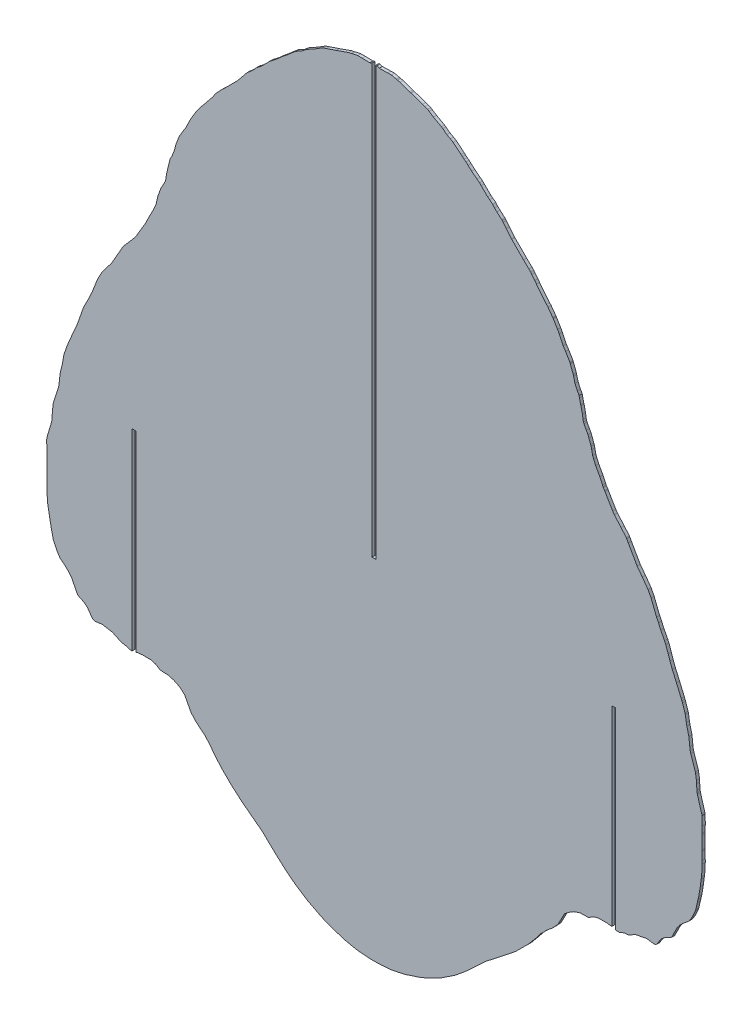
from build123d import *

# Parameters (mm, degrees)
EXTRUDE_1_DEPTH     = 2
SKETCH_3_W          = 2.5
SKETCH_3_H          = 60.5
CUT_EXTRUDE_1_DEPTH = 10


with BuildPart() as part:
    # Model → Extrude 1 (new body)
    with BuildSketch(Plane.XY):
        Polygon((-7497.9467, 2023.4558), (-7500.6426, 2017.1112), (-7501.0305, 2016.1207), (-7501.4279, 2015.1691), (-7503.0784, 2010.3746), (-7503.3023, 2009.66), (-7504.1535, 2004.848), (-7504.496, 2003.0145), (-7505.7197, 1998.1165), (-7506.4076, 1992.1158), (-7506.7012, 1990.1251), (-7506.946, 1989.2308), (-7510.1433, 1979.3137), (-7510.716, 1974.5936), (-7510.7209, 1974.5536), (-7510.7259, 1974.5137), (-7510.7487, 1974.0958), (-7510.7715, 1973.6781), (-7511.1722, 1968.5629), (-7511.4632, 1967.2933), (-7514.367, 1957.5712), (-7514.4008, 1956.9962), (-7514.4101, 1956.5912), (-7514.4193, 1956.1862), (-7514.4247, 1955.3981), (-7514.2628, 1947.1219), (-7514.2212, 1937.3397), (-7514.2091, 1936.9847), (-7514.3719, 1932.8768), (-7514.3864, 1930.5543), (-7514.1103, 1925.2838), (-7513.8456, 1921.2826), (-7513.1127, 1917.1886), (-7511.3726, 1907.7911), (-7510.8214, 1905.5643), (-7510.2805, 1902.9569), (-7507.7917, 1897.6613), (-7505.8454, 1894.5458), (-7503.2841, 1892.5111), (-7501.9998, 1891.3712), (-7499.9927, 1889.4144), (-7498.9104, 1887.8602), (-7498.3658, 1887.2845), (-7494.419, 1879.6002), (-7494.3736, 1879.5624), (-7494.3282, 1879.5245), (-7490.8269, 1877.798), (-7490.2704, 1877.4926), (-7488.3005, 1875.9325), (-7485.4491, 1871.9811), (-7484.6983, 1870.9366), (-7484.0835, 1870.7382), (-7483.4687, 1870.5397), (-7483.3924, 1870.4733), (-7483.316, 1870.4069), (-7482.274, 1870.5902), (-7478.4124, 1871.0638), (-7477.9965, 1870.9762), (-7477.5807, 1870.8885), (-7472.6305, 1870.0441), (-7472.0241, 1869.8947), (-7471.4176, 1869.745), (-7471.1804, 1869.6014), (-7470.9433, 1869.4576), (-7470.283, 1869.1666), (-7469.6228, 1868.8756), (-7466.2521, 1867.1725), (-7464.3822, 1866.9462), (-7463.2148, 1866.6659), (-7462.0473, 1866.3856), (-7461.513, 1866.0946), (-7460.9787, 1865.8033), (-7460.7605, 1865.7833), (-7460.5423, 1865.7633), (-7459.7682, 1865.7955), (-7459.2442, 1865.8174), (-7459.2442, 1990.1417), (-7458.9942, 1990.1417), (-7456.9942, 1990.1417), (-7456.7442, 1990.1417), (-7456.7442, 1866.3402), (-7456.4584, 1866.4423), (-7455.9226, 1866.6337), (-7452.735, 1866.9823), (-7447.3945, 1866.9166), (-7446.8888, 1866.9794), (-7444.6596, 1866.2577), (-7444.0137, 1866.0345), (-7441.2335, 1864.2804), (-7441.1634, 1864.2372), (-7441.0933, 1864.194), (-7441.0633, 1864.191), (-7441.0334, 1864.1881), (-7440.9624, 1864.1739), (-7440.8914, 1864.1595), (-7440.7779, 1864.1625), (-7440.6644, 1864.1652), (-7435.7736, 1863.9169), (-7435.3781, 1863.9164), (-7434.6278, 1863.6351), (-7433.8775, 1863.3536), (-7433.4218, 1863.2167), (-7432.6613, 1863.059), (-7431.854, 1862.7081), (-7428.3172, 1860.9379), (-7425.2409, 1858.1959), (-7425.2293, 1858.1852), (-7425.2177, 1858.1747), (-7424.9908, 1857.7369), (-7421.3787, 1850.8043), (-7421.003, 1850.2777), (-7418.5829, 1847.433), (-7416.2365, 1845.399), (-7412.2569, 1842.1661), (-7410.5129, 1840.1593), (-7409.7671, 1839.4247), (-7406.8879, 1835.6644), (-7402.7645, 1830.6551), (-7402.3004, 1830.1178), (-7401.8362, 1829.5804), (-7397.1856, 1824.89), (-7394.3311, 1822.0721), (-7391.2584, 1819.538), (-7390.4303, 1818.7936), (-7389.1507, 1817.6268), (-7386.6953, 1815.7213), (-7374.9699, 1806.7738), (-7370.1001, 1802.0641), (-7365.4616, 1797.7201), (-7360.5326, 1793.3229), (-7355.0083, 1788.9054), (-7353.362, 1787.6927), (-7350.607, 1785.8756), (-7345.9025, 1782.8116), (-7342.8212, 1781.2672), (-7338.9552, 1779.2279), (-7335.6744, 1777.6757), (-7332.1744, 1776.2101), (-7328.8162, 1774.9982), (-7324.9663, 1773.8363), (-7322.8491, 1773.1232), (-7322.1192, 1772.9066), (-7317.4443, 1771.8556), (-7317.3058, 1771.8246), (-7316.9245, 1771.7833), (-7313.7443, 1771.1263), (-7307.0124, 1770.5392), (-7302.6145, 1770.422), (-7297.9105, 1770.5692), (-7291.3652, 1771.1542), (-7288.5675, 1771.7479), (-7288.2836, 1771.7816), (-7287.9997, 1771.8151), (-7287.7908, 1771.8619), (-7287.5819, 1771.9088), (-7282.5796, 1773.0704), (-7281.8471, 1773.2906), (-7279.5327, 1774.0966), (-7275.6944, 1775.3065), (-7272.4718, 1776.4506), (-7269.6285, 1777.663), (-7266.5203, 1779.1383), (-7262.4004, 1781.285), (-7259.2552, 1782.8859), (-7254.3601, 1786.1176), (-7251.7627, 1787.8268), (-7250.3816, 1788.8214), (-7244.6867, 1793.4034), (-7240.6341, 1797.0858), (-7236.6093, 1800.7867), (-7230.3919, 1806.5961), (-7229.1579, 1807.5507), (-7212.9107, 1820.2904), (-7211.1697, 1821.8143), (-7204.0301, 1828.8754), (-7203.6757, 1829.2299), (-7202.7729, 1830.2147), (-7198.2298, 1835.6429), (-7195.1637, 1839.6456), (-7192.9741, 1841.7357), (-7191.7177, 1843.1935), (-7188.1277, 1846.1334), (-7187.2744, 1846.8663), (-7184.2405, 1850.1603), (-7183.9644, 1850.577), (-7179.7517, 1858.5421), (-7179.7426, 1858.5563), (-7179.7238, 1858.5734), (-7179.705, 1858.5905), (-7175.8548, 1861.4667), (-7174.1703, 1862.4039), (-7172.105, 1863.2098), (-7169.6242, 1864.0177), (-7168.7214, 1863.9991), (-7164.3725, 1864.1088), (-7164.2621, 1864.1268), (-7164.1516, 1864.1447), (-7161.5025, 1865.9171), (-7160.7705, 1866.2316), (-7157.9358, 1867.0131), (-7157.6336, 1866.9811), (-7152.4018, 1866.9789), (-7149.2442, 1866.6466), (-7149.2442, 1990.1417), (-7148.9942, 1990.1417), (-7146.9942, 1990.1417), (-7146.7442, 1990.1417), (-7146.7442, 1865.8138), (-7146.7356, 1865.8109), (-7144.831, 1865.7367), (-7144.4452, 1865.7391), (-7143.717, 1866.1136), (-7142.9889, 1866.4879), (-7141.9963, 1866.744), (-7141.0037, 1867.0001), (-7138.4158, 1867.2423), (-7134.6339, 1869.3578), (-7134.2803, 1869.5289), (-7134.0622, 1869.663), (-7133.6119, 1869.7863), (-7128.0332, 1870.8636), (-7126.8495, 1871.1188), (-7125.7958, 1870.9896), (-7124.7422, 1870.8602), (-7123.4416, 1870.6737), (-7122.8226, 1870.545), (-7122.2036, 1870.4161), (-7121.9822, 1870.6022), (-7121.3062, 1870.6793), (-7120.6302, 1870.7565), (-7119.7912, 1871.9027), (-7117.2733, 1875.6085), (-7117.2016, 1875.6847), (-7117.1299, 1875.7609), (-7117.0839, 1875.8419), (-7117.0379, 1875.923), (-7116.7871, 1876.1263), (-7114.8937, 1877.566), (-7114.3626, 1877.8517), (-7113.8316, 1878.1373), (-7110.8553, 1879.6276), (-7110.6672, 1879.7914), (-7106.8875, 1887.2306), (-7106.6991, 1887.4247), (-7106.5106, 1887.6188), (-7105.1686, 1889.4862), (-7103.6316, 1890.9938), (-7101.8646, 1892.5565), (-7100.081, 1893.912), (-7099.0223, 1894.9501), (-7097.3332, 1897.7479), (-7095.1587, 1902.5216), (-7095.0015, 1903.234), (-7093.9376, 1907.7653), (-7093.5925, 1909.3988), (-7093.085, 1911.3571), (-7092.0302, 1917.6908), (-7091.5307, 1921.8605), (-7091.2381, 1923.3607), (-7090.8495, 1930.5809), (-7090.8575, 1932.7682), (-7091.0507, 1937.7003), (-7090.9997, 1938.5343), (-7090.9768, 1946.8641), (-7091.0024, 1947.8505), (-7090.8322, 1952.015), (-7090.9019, 1957.7938), (-7090.9148, 1957.8397), (-7090.9278, 1957.8854), (-7091.1708, 1958.7394), (-7093.919, 1968.1774), (-7094.0616, 1968.823), (-7094.2191, 1970.3501), (-7094.5031, 1973.8024), (-7094.546, 1975.8514), (-7095.0951, 1978.9498), (-7095.2595, 1980.0636), (-7098.182, 1988.8456), (-7098.5345, 1990.1333), (-7098.8687, 1992.4855), (-7099.4575, 1997.8693), (-7100.7433, 2003.0062), (-7101.0871, 2004.8221), (-7101.7682, 2009.028), (-7102.0108, 2009.7946), (-7103.5566, 2014.5498), (-7103.9518, 2015.4976), (-7104.3956, 2016.629), (-7107.4665, 2023.8837), (-7110.19, 2030.0762), (-7111.6432, 2033.9207), (-7112.7766, 2037.2738), (-7114.3432, 2041.8114), (-7115.1853, 2043.6505), (-7117.5882, 2048.2667), (-7119.0656, 2051.599), (-7120.3442, 2054.1881), (-7123.8596, 2063.0946), (-7123.8655, 2063.1067), (-7123.8686, 2063.1122), (-7123.8716, 2063.1178), (-7125.8609, 2066.9584), (-7129.537, 2072.0748), (-7132.8078, 2076.3871), (-7138.6147, 2086.5865), (-7139.5852, 2088.3856), (-7139.8825, 2088.9581), (-7143.2775, 2092.8542), (-7147.5755, 2097.8612), (-7148.6157, 2099.3238), (-7153.6266, 2107.7745), (-7153.87, 2108.3241), (-7154.6501, 2109.4105), (-7154.8948, 2109.8671), (-7155.2402, 2110.6775), (-7156.9788, 2114.4181), (-7159.6612, 2119.2949), (-7160.9616, 2122.3004), (-7161.5578, 2123.849), (-7162.2329, 2127.0226), (-7162.5899, 2128.6849), (-7162.8861, 2129.3463), (-7164.0241, 2132.5216), (-7164.6521, 2134.3124), (-7165.7418, 2136.1444), (-7167.2061, 2138.8673), (-7167.5656, 2139.6754), (-7167.8196, 2141.0409), (-7168.2509, 2143.9373), (-7169.1793, 2148.0297), (-7169.3764, 2148.5503), (-7170.1062, 2151.9581), (-7170.371, 2153.1674), (-7171.4528, 2155.1886), (-7173.0456, 2158.6534), (-7173.9492, 2162.2008), (-7174.1538, 2163.0812), (-7176.0473, 2168.0165), (-7176.181, 2168.5404), (-7176.3353, 2168.8509), (-7179.0749, 2173.4442), (-7180.6272, 2175.8419), (-7183.2343, 2181.2609), (-7184.3011, 2183.3029), (-7187.0645, 2187.8041), (-7187.2553, 2188.1414), (-7187.4844, 2188.478), (-7190.5482, 2192.7003), (-7191.3981, 2193.6298), (-7197.8909, 2201.6671), (-7199.0249, 2203.3331), (-7200.9336, 2205.6151), (-7201.7343, 2206.7245), (-7202.8186, 2207.8118), (-7206.2899, 2211.1805), (-7213.8849, 2218.8096), (-7213.9452, 2218.8719), (-7214.0055, 2218.9344), (-7214.0205, 2218.9495), (-7214.0355, 2218.9645), (-7217.4817, 2223.1295), (-7219.4355, 2225.6378), (-7219.9285, 2226.2718), (-7220.0363, 2226.3722), (-7220.1442, 2226.4727), (-7220.2775, 2226.5721), (-7220.4107, 2226.6715), (-7223.5182, 2229.3931), (-7224.9534, 2230.7816), (-7226.2369, 2232.3411), (-7228.1849, 2233.8094), (-7229.4607, 2234.8231), (-7233.6817, 2238.9926), (-7234.7641, 2240.1051), (-7236.3494, 2241.3373), (-7239.7798, 2244.014), (-7242.1937, 2246.1334), (-7243.508, 2247.4015), (-7244.7711, 2248.3235), (-7245.7512, 2249.1291), (-7246.6643, 2249.9645), (-7251.8338, 2254.2417), (-7253.5044, 2255.2438), (-7255.8533, 2256.4569), (-7258.4648, 2258.5709), (-7259.4134, 2259.149), (-7264.4873, 2261.9563), (-7267.3197, 2263.7721), (-7268.4064, 2264.4728), (-7269.9691, 2265.0834), (-7271.5104, 2265.5558), (-7278.8352, 2268.1771), (-7279.1921, 2268.2438), (-7279.9044, 2268.4386), (-7286.0682, 2270.6998), (-7287.6266, 2270.9534), (-7288.0985, 2271.0941), (-7288.5703, 2271.235), (-7291.7647, 2271.9674), (-7294.1066, 2271.9252), (-7299.5401, 2271.7858), (-7301.0447, 2272.3602), (-7301.7442, 2272.3682), (-7301.7442, 2056.3378), (-7301.9942, 2056.3378), (-7303.9942, 2056.3378), (-7304.2442, 2056.3378), (-7304.2442, 2272.2856), (-7305.6078, 2271.8226), (-7310.4582, 2271.9342), (-7313.398, 2271.9579), (-7317.0286, 2271.1815), (-7317.8558, 2270.9506), (-7319.1767, 2270.7462), (-7327.2928, 2267.8932), (-7327.388, 2267.8656), (-7327.4356, 2267.8573), (-7333.7463, 2265.7059), (-7335.092, 2265.3026), (-7336.3783, 2264.808), (-7337.276, 2264.2235), (-7340.7956, 2261.9899), (-7346.5277, 2258.8253), (-7346.6629, 2258.7455), (-7346.7981, 2258.6654), (-7349.6802, 2256.3287), (-7352.3872, 2254.8956), (-7353.7481, 2254.0751), (-7358.4114, 2250.1207), (-7359.0913, 2249.5028), (-7361.3953, 2247.6141), (-7362.4685, 2246.7831), (-7362.675, 2246.5787), (-7362.8816, 2246.3746), (-7365.7547, 2243.8314), (-7369.296, 2241.0533), (-7370.4696, 2240.1405), (-7371.6427, 2238.9027), (-7375.7663, 2234.7997), (-7377.777, 2233.244), (-7378.9398, 2232.3817), (-7380.2642, 2230.7823), (-7381.6322, 2229.4667), (-7384.8557, 2226.6276), (-7385.3482, 2226.1788), (-7385.4061, 2226.0863), (-7385.4639, 2225.994), (-7387.4986, 2223.463), (-7390.7095, 2219.5338), (-7391.0565, 2219.1202), (-7391.147, 2219.0189), (-7398.7832, 2211.3383), (-7401.0719, 2209.1764), (-7402.8203, 2207.4039), (-7404.8589, 2205.1722), (-7406.2265, 2203.2758), (-7407.4618, 2201.496), (-7413.7755, 2193.6954), (-7414.6486, 2192.745), (-7417.7135, 2188.545), (-7417.8736, 2188.3116), (-7417.9398, 2188.1954), (-7418.0061, 2188.079), (-7420.9153, 2183.3192), (-7422.1023, 2181.0507), (-7424.5811, 2175.912), (-7426.1852, 2173.4357), (-7429.0358, 2168.5438), (-7429.0459, 2168.5233), (-7429.0559, 2168.5029), (-7429.0639, 2168.4706), (-7429.0719, 2168.4384), (-7431.0454, 2163.1393), (-7431.2273, 2162.3529), (-7432.2128, 2158.6588), (-7433.6487, 2155.3986), (-7434.6917, 2153.5048), (-7435.0014, 2152.1296), (-7435.888, 2148.4807), (-7435.9853, 2148.2229), (-7436.9688, 2143.9235), (-7437.4022, 2141.1313), (-7437.711, 2139.6036), (-7438.094, 2138.7711), (-7439.5297, 2136.0758), (-7440.5484, 2134.3339), (-7441.1381, 2132.7269), (-7442.3776, 2129.2902), (-7442.584, 2128.8302), (-7443.0663, 2126.6647), (-7443.766, 2123.5365), (-7444.3037, 2122.1935), (-7445.481, 2119.4932), (-7447.9444, 2114.9664), (-7449.8604, 2110.942), (-7450.3059, 2109.9047), (-7450.5668, 2109.4122), (-7451.5436, 2108.0321), (-7451.8589, 2107.3368), (-7456.5977, 2099.3512), (-7457.636, 2097.8812), (-7461.8783, 2092.9463), (-7465.1659, 2089.1885), (-7465.5454, 2088.4836), (-7466.8018, 2086.1772), (-7472.4782, 2076.3041), (-7475.7133, 2072.0431), (-7479.3552, 2066.9757), (-7480.6588, 2064.4467), (-7481.1405, 2063.5699), (-7481.818, 2062.1764), (-7484.9774, 2053.9297), (-7486.2246, 2051.4377), (-7487.6162, 2048.3102), (-7490.0433, 2043.6558), (-7490.8711, 2041.8434), (-7492.6136, 2036.787), (-7493.6729, 2033.662), (-7494.9649, 2030.2404), align=None)
    extrude(amount=EXTRUDE_1_DEPTH)

    # Sketch 3 → Cut-Extrude 1 (cut)
    with BuildSketch(Plane(origin=(0, 0, 0), x_dir=(-1, 0, 0), z_dir=(0, 0, -1))):
        with Locations((7302.9942, 2026.0878)):
            Rectangle(SKETCH_3_W, SKETCH_3_H)
    extrude(amount=-CUT_EXTRUDE_1_DEPTH, mode=Mode.SUBTRACT)


solid = part.part
